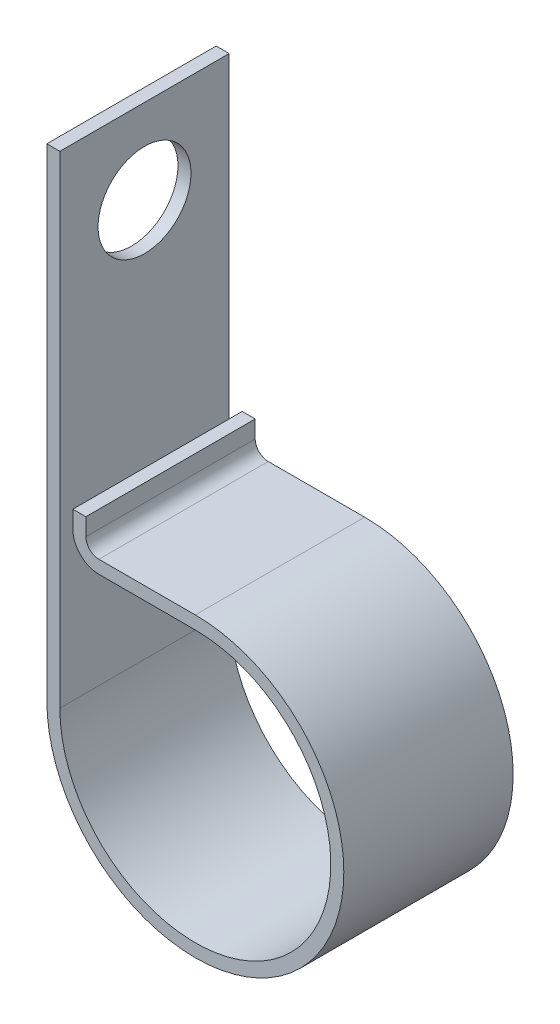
ISO-10303-21;
HEADER;
FILE_DESCRIPTION(('STEP AP214'),'2;1');
FILE_NAME('part.step','',(''),(''),'','','');
FILE_SCHEMA(('AUTOMOTIVE_DESIGN { 1 0 10303 214 1 1 1 1 }'));
ENDSEC;
DATA;
#1=APPLICATION_CONTEXT('core data for automotive mechanical design processes');
#2=APPLICATION_PROTOCOL_DEFINITION('international standard','automotive_design',2000,#1);
#3=PRODUCT_CONTEXT('',#1,'mechanical');
#4=PRODUCT('Part','Part','',(#3));
#5=PRODUCT_RELATED_PRODUCT_CATEGORY('part','',(#4));
#6=PRODUCT_DEFINITION_FORMATION('','',#4);
#7=PRODUCT_DEFINITION_CONTEXT('part definition',#1,'design');
#8=PRODUCT_DEFINITION('design','',#6,#7);
#9=PRODUCT_DEFINITION_SHAPE('','',#8);
#10=(LENGTH_UNIT() NAMED_UNIT(*) SI_UNIT(.MILLI.,.METRE.));
#11=(NAMED_UNIT(*) PLANE_ANGLE_UNIT() SI_UNIT($,.RADIAN.));
#12=(NAMED_UNIT(*) SI_UNIT($,.STERADIAN.) SOLID_ANGLE_UNIT());
#13=UNCERTAINTY_MEASURE_WITH_UNIT(LENGTH_MEASURE(1.E-05),#10,'distance_accuracy_value','');
#14=(GEOMETRIC_REPRESENTATION_CONTEXT(3) GLOBAL_UNCERTAINTY_ASSIGNED_CONTEXT((#13)) GLOBAL_UNIT_ASSIGNED_CONTEXT((#10,
#11,#12)) REPRESENTATION_CONTEXT('',''));
#15=CARTESIAN_POINT('',(0.,0.,0.));
#16=DIRECTION('',(0.,0.,1.));
#17=DIRECTION('',(1.,0.,0.));
#18=AXIS2_PLACEMENT_3D('',#15,#16,#17);
#19=CARTESIAN_POINT('',(0.,-37.2872,7.9375));
#20=DIRECTION('',(-1.,0.,0.));
#21=DIRECTION('',(0.,0.,1.));
#22=AXIS2_PLACEMENT_3D('',#19,#20,#21);
#23=PLANE('',#22);
#24=CARTESIAN_POINT('',(0.,0.,0.));
#25=DIRECTION('',(1.,0.,0.));
#26=DIRECTION('',(0.,0.,-1.));
#27=AXIS2_PLACEMENT_3D('',#24,#25,#26);
#28=CIRCLE('',#27,4.3561);
#29=CARTESIAN_POINT('',(0.,0.,-4.3561));
#30=VERTEX_POINT('',#29);
#31=EDGE_CURVE('E267',#30,#30,#28,.T.);
#32=ORIENTED_EDGE('',*,*,#31,.F.);
#33=EDGE_LOOP('',(#32));
#34=FACE_BOUND('',#33,.T.);
#35=DIRECTION('',(0.,1.,0.));
#36=VECTOR('',#35,1.);
#37=CARTESIAN_POINT('',(0.,-37.2872,-7.9375));
#38=LINE('',#37,#36);
#39=CARTESIAN_POINT('',(0.,-37.2872,-7.9375));
#40=VERTEX_POINT('',#39);
#41=CARTESIAN_POINT('',(0.,7.9248,-7.9375));
#42=VERTEX_POINT('',#41);
#43=EDGE_CURVE('E157',#40,#42,#38,.T.);
#44=ORIENTED_EDGE('',*,*,#43,.T.);
#45=DIRECTION('',(0.,0.,-1.));
#46=VECTOR('',#45,1.);
#47=CARTESIAN_POINT('',(0.,7.9248,7.9375));
#48=LINE('',#47,#46);
#49=CARTESIAN_POINT('',(0.,7.9248,7.9375));
#50=VERTEX_POINT('',#49);
#51=EDGE_CURVE('E11',#50,#42,#48,.T.);
#52=ORIENTED_EDGE('',*,*,#51,.F.);
#53=DIRECTION('',(0.,1.,0.));
#54=VECTOR('',#53,1.);
#55=CARTESIAN_POINT('',(0.,-37.2872,7.9375));
#56=LINE('',#55,#54);
#57=CARTESIAN_POINT('',(0.,-37.2872,7.9375));
#58=VERTEX_POINT('',#57);
#59=EDGE_CURVE('E105',#58,#50,#56,.T.);
#60=ORIENTED_EDGE('',*,*,#59,.F.);
#61=DIRECTION('',(0.,0.,-1.));
#62=VECTOR('',#61,1.);
#63=CARTESIAN_POINT('',(0.,-37.2872,7.9375));
#64=LINE('',#63,#62);
#65=EDGE_CURVE('E153',#58,#40,#64,.T.);
#66=ORIENTED_EDGE('',*,*,#65,.T.);
#67=EDGE_LOOP('',(#44,#52,#60,#66));
#68=FACE_BOUND('',#67,.T.);
#69=ADVANCED_FACE('F37',(#34,#68),#23,.F.);
#70=CARTESIAN_POINT('',(-1.2192,7.9248,7.9375));
#71=DIRECTION('',(0.,1.,0.));
#72=DIRECTION('',(-1.,0.,0.));
#73=AXIS2_PLACEMENT_3D('',#70,#71,#72);
#74=PLANE('',#73);
#75=DIRECTION('',(1.,0.,0.));
#76=VECTOR('',#75,1.);
#77=CARTESIAN_POINT('',(-1.2192,7.9248,-7.9375));
#78=LINE('',#77,#76);
#79=CARTESIAN_POINT('',(-1.2192,7.9248,-7.9375));
#80=VERTEX_POINT('',#79);
#81=EDGE_CURVE('E160',#80,#42,#78,.T.);
#82=ORIENTED_EDGE('',*,*,#81,.F.);
#83=DIRECTION('',(0.,0.,-1.));
#84=VECTOR('',#83,1.);
#85=CARTESIAN_POINT('',(-1.2192,7.9248,7.9375));
#86=LINE('',#85,#84);
#87=CARTESIAN_POINT('',(-1.2192,7.9248,7.9375));
#88=VERTEX_POINT('',#87);
#89=EDGE_CURVE('E45',#88,#80,#86,.T.);
#90=ORIENTED_EDGE('',*,*,#89,.F.);
#91=DIRECTION('',(1.,0.,0.));
#92=VECTOR('',#91,1.);
#93=CARTESIAN_POINT('',(-1.2192,7.9248,7.9375));
#94=LINE('',#93,#92);
#95=EDGE_CURVE('E223',#88,#50,#94,.T.);
#96=ORIENTED_EDGE('',*,*,#95,.T.);
#97=ORIENTED_EDGE('',*,*,#51,.T.);
#98=EDGE_LOOP('',(#82,#90,#96,#97));
#99=FACE_BOUND('',#98,.T.);
#100=ADVANCED_FACE('F210',(#99),#74,.T.);
#101=CARTESIAN_POINT('',(-1.2192,-37.2872,7.9375));
#102=DIRECTION('',(-1.,0.,0.));
#103=DIRECTION('',(0.,0.,1.));
#104=AXIS2_PLACEMENT_3D('',#101,#102,#103);
#105=PLANE('',#104);
#106=CARTESIAN_POINT('',(-1.2192,0.,0.));
#107=DIRECTION('',(-1.,0.,0.));
#108=DIRECTION('',(0.,0.,1.));
#109=AXIS2_PLACEMENT_3D('',#106,#107,#108);
#110=CIRCLE('',#109,4.3561);
#111=CARTESIAN_POINT('',(-1.2192,0.,4.3561));
#112=VERTEX_POINT('',#111);
#113=EDGE_CURVE('E161',#112,#112,#110,.T.);
#114=ORIENTED_EDGE('',*,*,#113,.F.);
#115=EDGE_LOOP('',(#114));
#116=FACE_BOUND('',#115,.T.);
#117=DIRECTION('',(0.,1.,0.));
#118=VECTOR('',#117,1.);
#119=CARTESIAN_POINT('',(-1.2192,-37.2872,-7.9375));
#120=LINE('',#119,#118);
#121=CARTESIAN_POINT('',(-1.2192,-37.2872,-7.9375));
#122=VERTEX_POINT('',#121);
#123=EDGE_CURVE('E164',#122,#80,#120,.T.);
#124=ORIENTED_EDGE('',*,*,#123,.F.);
#125=DIRECTION('',(0.,0.,-1.));
#126=VECTOR('',#125,1.);
#127=CARTESIAN_POINT('',(-1.2192,-37.2872,7.9375));
#128=LINE('',#127,#126);
#129=CARTESIAN_POINT('',(-1.2192,-37.2872,7.9375));
#130=VERTEX_POINT('',#129);
#131=EDGE_CURVE('E200',#130,#122,#128,.T.);
#132=ORIENTED_EDGE('',*,*,#131,.F.);
#133=DIRECTION('',(0.,1.,0.));
#134=VECTOR('',#133,1.);
#135=CARTESIAN_POINT('',(-1.2192,-37.2872,7.9375));
#136=LINE('',#135,#134);
#137=EDGE_CURVE('E207',#130,#88,#136,.T.);
#138=ORIENTED_EDGE('',*,*,#137,.T.);
#139=ORIENTED_EDGE('',*,*,#89,.T.);
#140=EDGE_LOOP('',(#124,#132,#138,#139));
#141=FACE_BOUND('',#140,.T.);
#142=ADVANCED_FACE('F205',(#116,#141),#105,.T.);
#143=CARTESIAN_POINT('',(12.7,-37.2872,7.9375));
#144=DIRECTION('',(0.,0.,-1.));
#145=DIRECTION('',(-1.,0.,0.));
#146=AXIS2_PLACEMENT_3D('',#143,#144,#145);
#147=CYLINDRICAL_SURFACE('',#146,13.9192);
#148=CARTESIAN_POINT('',(12.7,-37.2872,-7.9375));
#149=DIRECTION('',(0.,0.,1.));
#150=DIRECTION('',(1.,0.,0.));
#151=AXIS2_PLACEMENT_3D('',#148,#149,#150);
#152=CIRCLE('',#151,13.9192);
#153=CARTESIAN_POINT('',(12.7,-23.368,-7.9375));
#154=VERTEX_POINT('',#153);
#155=EDGE_CURVE('E167',#154,#122,#152,.F.);
#156=ORIENTED_EDGE('',*,*,#155,.F.);
#157=DIRECTION('',(0.,0.,-1.));
#158=VECTOR('',#157,1.);
#159=CARTESIAN_POINT('',(12.7,-23.368,7.9375));
#160=LINE('',#159,#158);
#161=CARTESIAN_POINT('',(12.7,-23.368,7.9375));
#162=VERTEX_POINT('',#161);
#163=EDGE_CURVE('E198',#162,#154,#160,.T.);
#164=ORIENTED_EDGE('',*,*,#163,.F.);
#165=CARTESIAN_POINT('',(12.7,-37.2872,7.9375));
#166=DIRECTION('',(0.,0.,1.));
#167=DIRECTION('',(1.,0.,0.));
#168=AXIS2_PLACEMENT_3D('',#165,#166,#167);
#169=CIRCLE('',#168,13.9192);
#170=EDGE_CURVE('E220',#162,#130,#169,.F.);
#171=ORIENTED_EDGE('',*,*,#170,.T.);
#172=ORIENTED_EDGE('',*,*,#131,.T.);
#173=EDGE_LOOP('',(#156,#164,#171,#172));
#174=FACE_BOUND('',#173,.T.);
#175=ADVANCED_FACE('F217',(#174),#147,.T.);
#176=CARTESIAN_POINT('',(12.7,-23.368,7.9375));
#177=DIRECTION('',(0.,1.,0.));
#178=DIRECTION('',(-1.,0.,0.));
#179=AXIS2_PLACEMENT_3D('',#176,#177,#178);
#180=PLANE('',#179);
#181=DIRECTION('',(1.,0.,0.));
#182=VECTOR('',#181,1.);
#183=CARTESIAN_POINT('',(12.7,-23.368,-7.9375));
#184=LINE('',#183,#182);
#185=CARTESIAN_POINT('',(3.6576,-23.368,-7.9375));
#186=VERTEX_POINT('',#185);
#187=EDGE_CURVE('E170',#186,#154,#184,.T.);
#188=ORIENTED_EDGE('',*,*,#187,.F.);
#189=DIRECTION('',(0.,0.,-1.));
#190=VECTOR('',#189,1.);
#191=CARTESIAN_POINT('',(3.6576,-23.368,7.9375));
#192=LINE('',#191,#190);
#193=CARTESIAN_POINT('',(3.6576,-23.368,7.9375));
#194=VERTEX_POINT('',#193);
#195=EDGE_CURVE('E196',#194,#186,#192,.T.);
#196=ORIENTED_EDGE('',*,*,#195,.F.);
#197=DIRECTION('',(1.,0.,0.));
#198=VECTOR('',#197,1.);
#199=CARTESIAN_POINT('',(12.7,-23.368,7.9375));
#200=LINE('',#199,#198);
#201=EDGE_CURVE('E225',#194,#162,#200,.T.);
#202=ORIENTED_EDGE('',*,*,#201,.T.);
#203=ORIENTED_EDGE('',*,*,#163,.T.);
#204=EDGE_LOOP('',(#188,#196,#202,#203));
#205=FACE_BOUND('',#204,.T.);
#206=ADVANCED_FACE('F296',(#205),#180,.T.);
#207=CARTESIAN_POINT('',(3.6576,-22.1488,7.9375));
#208=DIRECTION('',(0.,0.,-1.));
#209=DIRECTION('',(-1.,0.,0.));
#210=AXIS2_PLACEMENT_3D('',#207,#208,#209);
#211=CYLINDRICAL_SURFACE('',#210,1.2192);
#212=CARTESIAN_POINT('',(3.6576,-22.1488,-7.9375));
#213=DIRECTION('',(0.,0.,1.));
#214=DIRECTION('',(1.,0.,0.));
#215=AXIS2_PLACEMENT_3D('',#212,#213,#214);
#216=CIRCLE('',#215,1.2192);
#217=CARTESIAN_POINT('',(2.4384,-22.1488,-7.9375));
#218=VERTEX_POINT('',#217);
#219=EDGE_CURVE('E173',#218,#186,#216,.T.);
#220=ORIENTED_EDGE('',*,*,#219,.F.);
#221=DIRECTION('',(0.,0.,-1.));
#222=VECTOR('',#221,1.);
#223=CARTESIAN_POINT('',(2.4384,-22.1488,7.9375));
#224=LINE('',#223,#222);
#225=CARTESIAN_POINT('',(2.4384,-22.1488,7.9375));
#226=VERTEX_POINT('',#225);
#227=EDGE_CURVE('E194',#226,#218,#224,.T.);
#228=ORIENTED_EDGE('',*,*,#227,.F.);
#229=CARTESIAN_POINT('',(3.6576,-22.1488,7.9375));
#230=DIRECTION('',(0.,0.,1.));
#231=DIRECTION('',(1.,0.,0.));
#232=AXIS2_PLACEMENT_3D('',#229,#230,#231);
#233=CIRCLE('',#232,1.2192);
#234=EDGE_CURVE('E231',#226,#194,#233,.T.);
#235=ORIENTED_EDGE('',*,*,#234,.T.);
#236=ORIENTED_EDGE('',*,*,#195,.T.);
#237=EDGE_LOOP('',(#220,#228,#235,#236));
#238=FACE_BOUND('',#237,.T.);
#239=ADVANCED_FACE('F301',(#238),#211,.F.);
#240=CARTESIAN_POINT('',(2.4384,-20.5232,7.9375));
#241=DIRECTION('',(1.,0.,0.));
#242=DIRECTION('',(0.,0.,-1.));
#243=AXIS2_PLACEMENT_3D('',#240,#241,#242);
#244=PLANE('',#243);
#245=DIRECTION('',(0.,1.,0.));
#246=VECTOR('',#245,1.);
#247=CARTESIAN_POINT('',(2.4384,-20.5232,-7.9375));
#248=LINE('',#247,#246);
#249=CARTESIAN_POINT('',(2.4384,-20.5232,-7.9375));
#250=VERTEX_POINT('',#249);
#251=EDGE_CURVE('E176',#250,#218,#248,.F.);
#252=ORIENTED_EDGE('',*,*,#251,.F.);
#253=DIRECTION('',(0.,0.,-1.));
#254=VECTOR('',#253,1.);
#255=CARTESIAN_POINT('',(2.4384,-20.5232,7.9375));
#256=LINE('',#255,#254);
#257=CARTESIAN_POINT('',(2.4384,-20.5232,7.9375));
#258=VERTEX_POINT('',#257);
#259=EDGE_CURVE('E192',#258,#250,#256,.T.);
#260=ORIENTED_EDGE('',*,*,#259,.F.);
#261=DIRECTION('',(0.,1.,0.));
#262=VECTOR('',#261,1.);
#263=CARTESIAN_POINT('',(2.4384,-20.5232,7.9375));
#264=LINE('',#263,#262);
#265=EDGE_CURVE('E234',#258,#226,#264,.F.);
#266=ORIENTED_EDGE('',*,*,#265,.T.);
#267=ORIENTED_EDGE('',*,*,#227,.T.);
#268=EDGE_LOOP('',(#252,#260,#266,#267));
#269=FACE_BOUND('',#268,.T.);
#270=ADVANCED_FACE('F246',(#269),#244,.T.);
#271=CARTESIAN_POINT('',(1.2192,-20.5232,7.9375));
#272=DIRECTION('',(0.,1.,0.));
#273=DIRECTION('',(0.,0.,1.));
#274=AXIS2_PLACEMENT_3D('',#271,#272,#273);
#275=PLANE('',#274);
#276=DIRECTION('',(1.,0.,0.));
#277=VECTOR('',#276,1.);
#278=CARTESIAN_POINT('',(1.2192,-20.5232,-7.9375));
#279=LINE('',#278,#277);
#280=CARTESIAN_POINT('',(1.2192,-20.5232,-7.9375));
#281=VERTEX_POINT('',#280);
#282=EDGE_CURVE('E179',#281,#250,#279,.T.);
#283=ORIENTED_EDGE('',*,*,#282,.F.);
#284=DIRECTION('',(0.,0.,-1.));
#285=VECTOR('',#284,1.);
#286=CARTESIAN_POINT('',(1.2192,-20.5232,7.9375));
#287=LINE('',#286,#285);
#288=CARTESIAN_POINT('',(1.2192,-20.5232,7.9375));
#289=VERTEX_POINT('',#288);
#290=EDGE_CURVE('E190',#289,#281,#287,.T.);
#291=ORIENTED_EDGE('',*,*,#290,.F.);
#292=DIRECTION('',(1.,0.,0.));
#293=VECTOR('',#292,1.);
#294=CARTESIAN_POINT('',(1.2192,-20.5232,7.9375));
#295=LINE('',#294,#293);
#296=EDGE_CURVE('E237',#289,#258,#295,.T.);
#297=ORIENTED_EDGE('',*,*,#296,.T.);
#298=ORIENTED_EDGE('',*,*,#259,.T.);
#299=EDGE_LOOP('',(#283,#291,#297,#298));
#300=FACE_BOUND('',#299,.T.);
#301=ADVANCED_FACE('F241',(#300),#275,.T.);
#302=CARTESIAN_POINT('',(1.2192,-20.5232,7.9375));
#303=DIRECTION('',(1.,0.,0.));
#304=DIRECTION('',(0.,0.,-1.));
#305=AXIS2_PLACEMENT_3D('',#302,#303,#304);
#306=PLANE('',#305);
#307=DIRECTION('',(0.,-1.,0.));
#308=VECTOR('',#307,1.);
#309=CARTESIAN_POINT('',(1.2192,-20.5232,-7.9375));
#310=LINE('',#309,#308);
#311=CARTESIAN_POINT('',(1.2192,-22.1488,-7.9375));
#312=VERTEX_POINT('',#311);
#313=EDGE_CURVE('E182',#281,#312,#310,.T.);
#314=ORIENTED_EDGE('',*,*,#313,.T.);
#315=DIRECTION('',(0.,0.,-1.));
#316=VECTOR('',#315,1.);
#317=CARTESIAN_POINT('',(1.2192,-22.1488,7.9375));
#318=LINE('',#317,#316);
#319=CARTESIAN_POINT('',(1.2192,-22.1488,7.9375));
#320=VERTEX_POINT('',#319);
#321=EDGE_CURVE('E148',#320,#312,#318,.T.);
#322=ORIENTED_EDGE('',*,*,#321,.F.);
#323=DIRECTION('',(0.,-1.,0.));
#324=VECTOR('',#323,1.);
#325=CARTESIAN_POINT('',(1.2192,-20.5232,7.9375));
#326=LINE('',#325,#324);
#327=EDGE_CURVE('E139',#289,#320,#326,.T.);
#328=ORIENTED_EDGE('',*,*,#327,.F.);
#329=ORIENTED_EDGE('',*,*,#290,.T.);
#330=EDGE_LOOP('',(#314,#322,#328,#329));
#331=FACE_BOUND('',#330,.T.);
#332=ADVANCED_FACE('F250',(#331),#306,.F.);
#333=CARTESIAN_POINT('',(3.6576,-22.1488,7.9375));
#334=DIRECTION('',(0.,0.,-1.));
#335=DIRECTION('',(-1.,0.,0.));
#336=AXIS2_PLACEMENT_3D('',#333,#334,#335);
#337=CYLINDRICAL_SURFACE('',#336,2.4384);
#338=CARTESIAN_POINT('',(3.6576,-22.1488,-7.9375));
#339=DIRECTION('',(0.,0.,1.));
#340=DIRECTION('',(-1.,0.,0.));
#341=AXIS2_PLACEMENT_3D('',#338,#339,#340);
#342=CIRCLE('',#341,2.4384);
#343=CARTESIAN_POINT('',(3.6576,-24.5872,-7.9375));
#344=VERTEX_POINT('',#343);
#345=EDGE_CURVE('E147',#312,#344,#342,.T.);
#346=ORIENTED_EDGE('',*,*,#345,.T.);
#347=DIRECTION('',(0.,0.,-1.));
#348=VECTOR('',#347,1.);
#349=CARTESIAN_POINT('',(3.6576,-24.5872,7.9375));
#350=LINE('',#349,#348);
#351=CARTESIAN_POINT('',(3.6576,-24.5872,7.9375));
#352=VERTEX_POINT('',#351);
#353=EDGE_CURVE('E144',#352,#344,#350,.T.);
#354=ORIENTED_EDGE('',*,*,#353,.F.);
#355=CARTESIAN_POINT('',(3.6576,-22.1488,7.9375));
#356=DIRECTION('',(0.,0.,1.));
#357=DIRECTION('',(-1.,0.,0.));
#358=AXIS2_PLACEMENT_3D('',#355,#356,#357);
#359=CIRCLE('',#358,2.4384);
#360=EDGE_CURVE('E132',#320,#352,#359,.T.);
#361=ORIENTED_EDGE('',*,*,#360,.F.);
#362=ORIENTED_EDGE('',*,*,#321,.T.);
#363=EDGE_LOOP('',(#346,#354,#361,#362));
#364=FACE_BOUND('',#363,.T.);
#365=ADVANCED_FACE('F145',(#364),#337,.T.);
#366=CARTESIAN_POINT('',(12.7,-24.5872,7.9375));
#367=DIRECTION('',(0.,1.,0.));
#368=DIRECTION('',(-1.,0.,0.));
#369=AXIS2_PLACEMENT_3D('',#366,#367,#368);
#370=PLANE('',#369);
#371=DIRECTION('',(1.,0.,0.));
#372=VECTOR('',#371,1.);
#373=CARTESIAN_POINT('',(12.7,-24.5872,-7.9375));
#374=LINE('',#373,#372);
#375=CARTESIAN_POINT('',(12.7,-24.5872,-7.9375));
#376=VERTEX_POINT('',#375);
#377=EDGE_CURVE('E93',#344,#376,#374,.T.);
#378=ORIENTED_EDGE('',*,*,#377,.T.);
#379=DIRECTION('',(0.,0.,-1.));
#380=VECTOR('',#379,1.);
#381=CARTESIAN_POINT('',(12.7,-24.5872,7.9375));
#382=LINE('',#381,#380);
#383=CARTESIAN_POINT('',(12.7,-24.5872,7.9375));
#384=VERTEX_POINT('',#383);
#385=EDGE_CURVE('E149',#384,#376,#382,.T.);
#386=ORIENTED_EDGE('',*,*,#385,.F.);
#387=DIRECTION('',(1.,0.,0.));
#388=VECTOR('',#387,1.);
#389=CARTESIAN_POINT('',(12.7,-24.5872,7.9375));
#390=LINE('',#389,#388);
#391=EDGE_CURVE('E136',#352,#384,#390,.T.);
#392=ORIENTED_EDGE('',*,*,#391,.F.);
#393=ORIENTED_EDGE('',*,*,#353,.T.);
#394=EDGE_LOOP('',(#378,#386,#392,#393));
#395=FACE_BOUND('',#394,.T.);
#396=ADVANCED_FACE('F151',(#395),#370,.F.);
#397=CARTESIAN_POINT('',(12.7,-37.2872,7.9375));
#398=DIRECTION('',(0.,0.,-1.));
#399=DIRECTION('',(-1.,0.,0.));
#400=AXIS2_PLACEMENT_3D('',#397,#398,#399);
#401=CYLINDRICAL_SURFACE('',#400,12.7);
#402=CARTESIAN_POINT('',(12.7,-37.2872,-7.9375));
#403=DIRECTION('',(0.,0.,-1.));
#404=DIRECTION('',(1.,0.,0.));
#405=AXIS2_PLACEMENT_3D('',#402,#403,#404);
#406=CIRCLE('',#405,12.7);
#407=EDGE_CURVE('E99',#376,#40,#406,.T.);
#408=ORIENTED_EDGE('',*,*,#407,.T.);
#409=ORIENTED_EDGE('',*,*,#65,.F.);
#410=CARTESIAN_POINT('',(12.7,-37.2872,7.9375));
#411=DIRECTION('',(0.,0.,-1.));
#412=DIRECTION('',(1.,0.,0.));
#413=AXIS2_PLACEMENT_3D('',#410,#411,#412);
#414=CIRCLE('',#413,12.7);
#415=EDGE_CURVE('E53',#384,#58,#414,.T.);
#416=ORIENTED_EDGE('',*,*,#415,.F.);
#417=ORIENTED_EDGE('',*,*,#385,.T.);
#418=EDGE_LOOP('',(#408,#409,#416,#417));
#419=FACE_BOUND('',#418,.T.);
#420=ADVANCED_FACE('F268',(#419),#401,.F.);
#421=CARTESIAN_POINT('',(12.7,-37.2872,7.9375));
#422=DIRECTION('',(0.,0.,1.));
#423=DIRECTION('',(1.,0.,0.));
#424=AXIS2_PLACEMENT_3D('',#421,#422,#423);
#425=PLANE('',#424);
#426=ORIENTED_EDGE('',*,*,#59,.T.);
#427=ORIENTED_EDGE('',*,*,#95,.F.);
#428=ORIENTED_EDGE('',*,*,#137,.F.);
#429=ORIENTED_EDGE('',*,*,#170,.F.);
#430=ORIENTED_EDGE('',*,*,#201,.F.);
#431=ORIENTED_EDGE('',*,*,#234,.F.);
#432=ORIENTED_EDGE('',*,*,#265,.F.);
#433=ORIENTED_EDGE('',*,*,#296,.F.);
#434=ORIENTED_EDGE('',*,*,#327,.T.);
#435=ORIENTED_EDGE('',*,*,#360,.T.);
#436=ORIENTED_EDGE('',*,*,#391,.T.);
#437=ORIENTED_EDGE('',*,*,#415,.T.);
#438=EDGE_LOOP('',(#426,#427,#428,#429,#430,#431,#432,#433,#434,#435,#436,#437));
#439=FACE_BOUND('',#438,.T.);
#440=ADVANCED_FACE('F134',(#439),#425,.T.);
#441=CARTESIAN_POINT('',(12.7,-37.2872,-7.9375));
#442=DIRECTION('',(0.,0.,1.));
#443=DIRECTION('',(1.,0.,0.));
#444=AXIS2_PLACEMENT_3D('',#441,#442,#443);
#445=PLANE('',#444);
#446=ORIENTED_EDGE('',*,*,#43,.F.);
#447=ORIENTED_EDGE('',*,*,#407,.F.);
#448=ORIENTED_EDGE('',*,*,#377,.F.);
#449=ORIENTED_EDGE('',*,*,#345,.F.);
#450=ORIENTED_EDGE('',*,*,#313,.F.);
#451=ORIENTED_EDGE('',*,*,#282,.T.);
#452=ORIENTED_EDGE('',*,*,#251,.T.);
#453=ORIENTED_EDGE('',*,*,#219,.T.);
#454=ORIENTED_EDGE('',*,*,#187,.T.);
#455=ORIENTED_EDGE('',*,*,#155,.T.);
#456=ORIENTED_EDGE('',*,*,#123,.T.);
#457=ORIENTED_EDGE('',*,*,#81,.T.);
#458=EDGE_LOOP('',(#446,#447,#448,#449,#450,#451,#452,#453,#454,#455,#456,#457));
#459=FACE_BOUND('',#458,.T.);
#460=ADVANCED_FACE('F213',(#459),#445,.F.);
#461=CARTESIAN_POINT('',(0.,0.,0.));
#462=DIRECTION('',(1.,0.,0.));
#463=DIRECTION('',(0.,0.,-1.));
#464=AXIS2_PLACEMENT_3D('',#461,#462,#463);
#465=CYLINDRICAL_SURFACE('',#464,4.3561);
#466=ORIENTED_EDGE('',*,*,#31,.T.);
#467=EDGE_LOOP('',(#466));
#468=FACE_BOUND('',#467,.T.);
#469=ORIENTED_EDGE('',*,*,#113,.T.);
#470=EDGE_LOOP('',(#469));
#471=FACE_BOUND('',#470,.T.);
#472=ADVANCED_FACE('F279',(#468,#471),#465,.F.);
#473=CLOSED_SHELL('',(#69,#100,#142,#175,#206,#239,#270,#301,#332,#365,#396,#420,#440,#460,#472));
#474=MANIFOLD_SOLID_BREP('B2',#473);
#475=ADVANCED_BREP_SHAPE_REPRESENTATION('',(#18,#474),#14);
#476=SHAPE_DEFINITION_REPRESENTATION(#9,#475);
ENDSEC;
END-ISO-10303-21;
